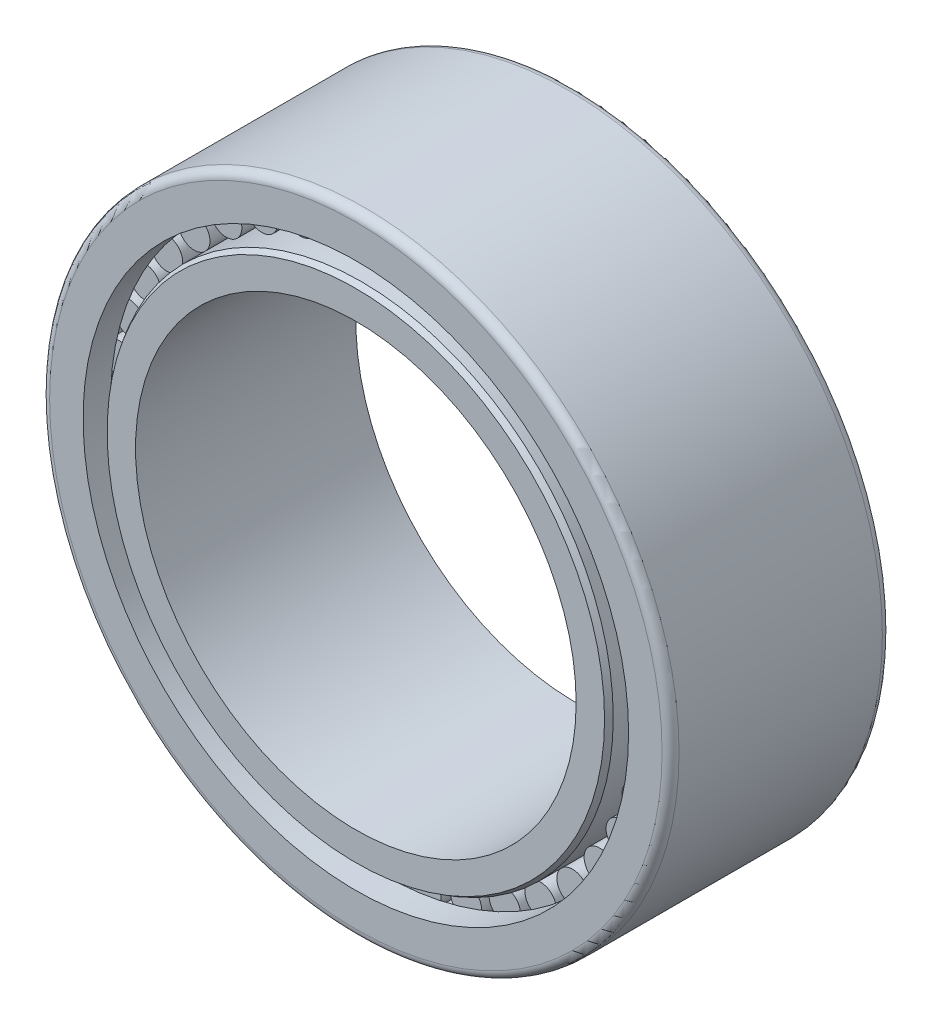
from build123d import *

# Parameters (mm, degrees)
BASESKE_W            = 26.25
BASESKE_H            = 2.5
FILLET1_R            = 1.35
CIRPATTERNBALL_COUNT = 40


with BuildPart() as part:
    # BaseSke → Roller (revolve)
    with BuildSketch(Plane(origin=(0, 0, 0), x_dir=(0, 0, -1), z_dir=(1, 0, 0)), mode=Mode.PRIVATE) as roller_sk:
        with Locations((0, 41.25)):
            Rectangle(BASESKE_W, BASESKE_H)
    roller = revolve(roller_sk.sketch.rotate(Axis((0, 42.5, 13.125), (0, 0, -1)), 270), axis=Axis((0, 42.5, 13.125), (0, 0, -1)))

    # OuterRaceSke → OuterRace (revolve)
    with BuildSketch(Plane(origin=(0, 0, 0), x_dir=(0, 0, -1), z_dir=(1, 0, 0)), mode=Mode.PRIVATE) as outerrace_sk:
        Polygon((-17.5, 50), (17.5, 50), (17.5, 43.333333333), (13.15, 43.333333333), (13.15, 44.98), (-13.15, 44.98), (-13.15, 43.333333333), (-17.5, 43.333333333), align=None)
    revolve(outerrace_sk.sketch.rotate(Axis((0, 0, 50.391616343), (0, 0, -1)), 90), axis=Axis((0, 0, 50.391616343), (0, 0, -1)))

    # InnerRaceSke → InnerRace (revolve)
    with BuildSketch(Plane(origin=(0, 0, 0), x_dir=(0, 0, -1), z_dir=(1, 0, 0)), mode=Mode.PRIVATE) as innerrace_sk:
        Polygon((-17.5, 35), (17.5, 35), (17.5, 39.514818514), (16.625, 40.02), (-16.625, 40.02), (-17.5, 39.514818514), align=None)
    revolve(innerrace_sk.sketch.rotate(Axis((0, 0, 70.862590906), (0, 0, -1)), 90), axis=Axis((0, 0, 70.862590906), (0, 0, -1)))

    # Fillet1
    fillet1_edges = [part.edges().sort_by_distance(p)[0] for p in [
        (-50, 0, 17.5),
        (-50, 0, -17.5),
    ]]
    fillet(fillet1_edges, radius=FILLET1_R)

    # CirPatternBall: Roller ×40 about axis
    cirpatternball_axis = Axis((0, 0, 0), (0, 0, 1))
    for i in range(1, CIRPATTERNBALL_COUNT):
        add(roller.rotate(cirpatternball_axis, i * 360 / CIRPATTERNBALL_COUNT))


solid = part.part
